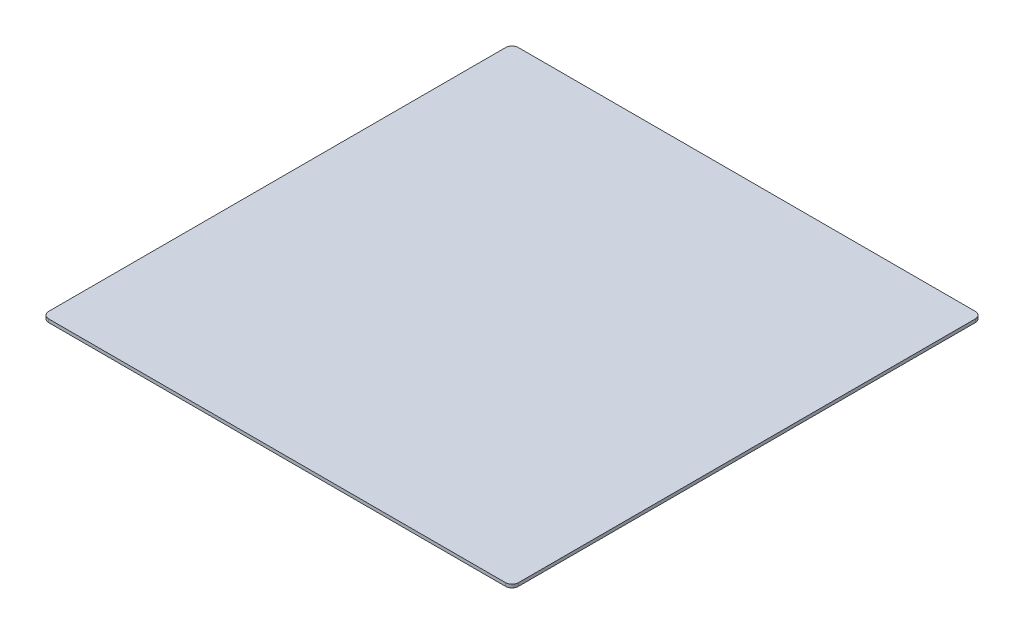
ISO-10303-21;
HEADER;
FILE_DESCRIPTION(('STEP AP214'),'2;1');
FILE_NAME('part.step','',(''),(''),'','','');
FILE_SCHEMA(('AUTOMOTIVE_DESIGN { 1 0 10303 214 1 1 1 1 }'));
ENDSEC;
DATA;
#1=APPLICATION_CONTEXT('core data for automotive mechanical design processes');
#2=APPLICATION_PROTOCOL_DEFINITION('international standard','automotive_design',2000,#1);
#3=PRODUCT_CONTEXT('',#1,'mechanical');
#4=PRODUCT('Part','Part','',(#3));
#5=PRODUCT_RELATED_PRODUCT_CATEGORY('part','',(#4));
#6=PRODUCT_DEFINITION_FORMATION('','',#4);
#7=PRODUCT_DEFINITION_CONTEXT('part definition',#1,'design');
#8=PRODUCT_DEFINITION('design','',#6,#7);
#9=PRODUCT_DEFINITION_SHAPE('','',#8);
#10=(LENGTH_UNIT() NAMED_UNIT(*) SI_UNIT(.MILLI.,.METRE.));
#11=(NAMED_UNIT(*) PLANE_ANGLE_UNIT() SI_UNIT($,.RADIAN.));
#12=(NAMED_UNIT(*) SI_UNIT($,.STERADIAN.) SOLID_ANGLE_UNIT());
#13=UNCERTAINTY_MEASURE_WITH_UNIT(LENGTH_MEASURE(1.E-05),#10,'distance_accuracy_value','');
#14=(GEOMETRIC_REPRESENTATION_CONTEXT(3) GLOBAL_UNCERTAINTY_ASSIGNED_CONTEXT((#13)) GLOBAL_UNIT_ASSIGNED_CONTEXT((#10,
#11,#12)) REPRESENTATION_CONTEXT('',''));
#15=CARTESIAN_POINT('',(0.,0.,0.));
#16=DIRECTION('',(0.,0.,1.));
#17=DIRECTION('',(1.,0.,0.));
#18=AXIS2_PLACEMENT_3D('',#15,#16,#17);
#19=CARTESIAN_POINT('',(228.6,3.175,228.6));
#20=DIRECTION('',(-1.,0.,0.));
#21=DIRECTION('',(0.,0.,1.));
#22=AXIS2_PLACEMENT_3D('',#19,#20,#21);
#23=PLANE('',#22);
#24=DIRECTION('',(0.,0.,-1.));
#25=VECTOR('',#24,1.);
#26=CARTESIAN_POINT('',(228.6,0.,228.6));
#27=LINE('',#26,#25);
#28=CARTESIAN_POINT('',(228.6,0.,222.25));
#29=VERTEX_POINT('',#28);
#30=CARTESIAN_POINT('',(228.6,0.,-222.25));
#31=VERTEX_POINT('',#30);
#32=EDGE_CURVE('E140',#29,#31,#27,.T.);
#33=ORIENTED_EDGE('',*,*,#32,.T.);
#34=DIRECTION('',(0.,-1.,0.));
#35=VECTOR('',#34,1.);
#36=CARTESIAN_POINT('',(228.6,3.175,-222.25));
#37=LINE('',#36,#35);
#38=CARTESIAN_POINT('',(228.6,3.175,-222.25));
#39=VERTEX_POINT('',#38);
#40=EDGE_CURVE('E174',#31,#39,#37,.F.);
#41=ORIENTED_EDGE('',*,*,#40,.T.);
#42=DIRECTION('',(0.,0.,-1.));
#43=VECTOR('',#42,1.);
#44=CARTESIAN_POINT('',(228.6,3.175,228.6));
#45=LINE('',#44,#43);
#46=CARTESIAN_POINT('',(228.6,3.175,222.25));
#47=VERTEX_POINT('',#46);
#48=EDGE_CURVE('E138',#47,#39,#45,.T.);
#49=ORIENTED_EDGE('',*,*,#48,.F.);
#50=DIRECTION('',(0.,-1.,0.));
#51=VECTOR('',#50,1.);
#52=CARTESIAN_POINT('',(228.6,3.175,222.25));
#53=LINE('',#52,#51);
#54=EDGE_CURVE('E170',#47,#29,#53,.T.);
#55=ORIENTED_EDGE('',*,*,#54,.T.);
#56=EDGE_LOOP('',(#33,#41,#49,#55));
#57=FACE_BOUND('',#56,.T.);
#58=ADVANCED_FACE('F38',(#57),#23,.F.);
#59=CARTESIAN_POINT('',(-228.6,3.175,-228.6));
#60=DIRECTION('',(0.,0.,1.));
#61=DIRECTION('',(1.,0.,0.));
#62=AXIS2_PLACEMENT_3D('',#59,#60,#61);
#63=PLANE('',#62);
#64=DIRECTION('',(-1.,0.,0.));
#65=VECTOR('',#64,1.);
#66=CARTESIAN_POINT('',(-228.6,0.,-228.6));
#67=LINE('',#66,#65);
#68=CARTESIAN_POINT('',(222.25,0.,-228.6));
#69=VERTEX_POINT('',#68);
#70=CARTESIAN_POINT('',(-222.25,0.,-228.6));
#71=VERTEX_POINT('',#70);
#72=EDGE_CURVE('E133',#69,#71,#67,.T.);
#73=ORIENTED_EDGE('',*,*,#72,.T.);
#74=DIRECTION('',(0.,-1.,0.));
#75=VECTOR('',#74,1.);
#76=CARTESIAN_POINT('',(-222.25,3.175,-228.6));
#77=LINE('',#76,#75);
#78=CARTESIAN_POINT('',(-222.25,3.175,-228.6));
#79=VERTEX_POINT('',#78);
#80=EDGE_CURVE('E109',#71,#79,#77,.F.);
#81=ORIENTED_EDGE('',*,*,#80,.T.);
#82=DIRECTION('',(-1.,0.,0.));
#83=VECTOR('',#82,1.);
#84=CARTESIAN_POINT('',(-228.6,3.175,-228.6));
#85=LINE('',#84,#83);
#86=CARTESIAN_POINT('',(222.25,3.175,-228.6));
#87=VERTEX_POINT('',#86);
#88=EDGE_CURVE('E194',#87,#79,#85,.T.);
#89=ORIENTED_EDGE('',*,*,#88,.F.);
#90=DIRECTION('',(0.,-1.,0.));
#91=VECTOR('',#90,1.);
#92=CARTESIAN_POINT('',(222.25,3.175,-228.6));
#93=LINE('',#92,#91);
#94=EDGE_CURVE('E115',#87,#69,#93,.T.);
#95=ORIENTED_EDGE('',*,*,#94,.T.);
#96=EDGE_LOOP('',(#73,#81,#89,#95));
#97=FACE_BOUND('',#96,.T.);
#98=ADVANCED_FACE('F219',(#97),#63,.F.);
#99=CARTESIAN_POINT('',(-228.6,3.175,228.6));
#100=DIRECTION('',(1.,0.,0.));
#101=DIRECTION('',(0.,0.,-1.));
#102=AXIS2_PLACEMENT_3D('',#99,#100,#101);
#103=PLANE('',#102);
#104=DIRECTION('',(0.,0.,1.));
#105=VECTOR('',#104,1.);
#106=CARTESIAN_POINT('',(-228.6,3.175,228.6));
#107=LINE('',#106,#105);
#108=CARTESIAN_POINT('',(-228.6,3.175,-222.25));
#109=VERTEX_POINT('',#108);
#110=CARTESIAN_POINT('',(-228.6,3.175,222.25));
#111=VERTEX_POINT('',#110);
#112=EDGE_CURVE('E124',#109,#111,#107,.T.);
#113=ORIENTED_EDGE('',*,*,#112,.F.);
#114=DIRECTION('',(0.,-1.,0.));
#115=VECTOR('',#114,1.);
#116=CARTESIAN_POINT('',(-228.6,3.175,-222.25));
#117=LINE('',#116,#115);
#118=CARTESIAN_POINT('',(-228.6,0.,-222.25));
#119=VERTEX_POINT('',#118);
#120=EDGE_CURVE('E108',#109,#119,#117,.T.);
#121=ORIENTED_EDGE('',*,*,#120,.T.);
#122=DIRECTION('',(0.,0.,1.));
#123=VECTOR('',#122,1.);
#124=CARTESIAN_POINT('',(-228.6,0.,228.6));
#125=LINE('',#124,#123);
#126=CARTESIAN_POINT('',(-228.6,0.,222.25));
#127=VERTEX_POINT('',#126);
#128=EDGE_CURVE('E122',#119,#127,#125,.T.);
#129=ORIENTED_EDGE('',*,*,#128,.T.);
#130=DIRECTION('',(0.,-1.,0.));
#131=VECTOR('',#130,1.);
#132=CARTESIAN_POINT('',(-228.6,3.175,222.25));
#133=LINE('',#132,#131);
#134=EDGE_CURVE('E127',#127,#111,#133,.F.);
#135=ORIENTED_EDGE('',*,*,#134,.T.);
#136=EDGE_LOOP('',(#113,#121,#129,#135));
#137=FACE_BOUND('',#136,.T.);
#138=ADVANCED_FACE('F121',(#137),#103,.F.);
#139=CARTESIAN_POINT('',(-228.6,3.175,228.6));
#140=DIRECTION('',(0.,0.,-1.));
#141=DIRECTION('',(-1.,0.,0.));
#142=AXIS2_PLACEMENT_3D('',#139,#140,#141);
#143=PLANE('',#142);
#144=DIRECTION('',(1.,0.,0.));
#145=VECTOR('',#144,1.);
#146=CARTESIAN_POINT('',(-228.6,0.,228.6));
#147=LINE('',#146,#145);
#148=CARTESIAN_POINT('',(-222.25,0.,228.6));
#149=VERTEX_POINT('',#148);
#150=CARTESIAN_POINT('',(222.25,0.,228.6));
#151=VERTEX_POINT('',#150);
#152=EDGE_CURVE('E132',#149,#151,#147,.T.);
#153=ORIENTED_EDGE('',*,*,#152,.T.);
#154=DIRECTION('',(0.,-1.,0.));
#155=VECTOR('',#154,1.);
#156=CARTESIAN_POINT('',(222.25,3.175,228.6));
#157=LINE('',#156,#155);
#158=CARTESIAN_POINT('',(222.25,3.175,228.6));
#159=VERTEX_POINT('',#158);
#160=EDGE_CURVE('E11',#151,#159,#157,.F.);
#161=ORIENTED_EDGE('',*,*,#160,.T.);
#162=DIRECTION('',(1.,0.,0.));
#163=VECTOR('',#162,1.);
#164=CARTESIAN_POINT('',(-228.6,3.175,228.6));
#165=LINE('',#164,#163);
#166=CARTESIAN_POINT('',(-222.25,3.175,228.6));
#167=VERTEX_POINT('',#166);
#168=EDGE_CURVE('E145',#167,#159,#165,.T.);
#169=ORIENTED_EDGE('',*,*,#168,.F.);
#170=DIRECTION('',(0.,-1.,0.));
#171=VECTOR('',#170,1.);
#172=CARTESIAN_POINT('',(-222.25,3.175,228.6));
#173=LINE('',#172,#171);
#174=EDGE_CURVE('E47',#167,#149,#173,.T.);
#175=ORIENTED_EDGE('',*,*,#174,.T.);
#176=EDGE_LOOP('',(#153,#161,#169,#175));
#177=FACE_BOUND('',#176,.T.);
#178=ADVANCED_FACE('F180',(#177),#143,.F.);
#179=CARTESIAN_POINT('',(0.,3.175,0.));
#180=DIRECTION('',(0.,-1.,0.));
#181=DIRECTION('',(0.,0.,-1.));
#182=AXIS2_PLACEMENT_3D('',#179,#180,#181);
#183=PLANE('',#182);
#184=ORIENTED_EDGE('',*,*,#88,.T.);
#185=CARTESIAN_POINT('',(-222.25,3.175,-222.25));
#186=DIRECTION('',(0.,-1.,0.));
#187=DIRECTION('',(0.,0.,-1.));
#188=AXIS2_PLACEMENT_3D('',#185,#186,#187);
#189=CIRCLE('',#188,6.35);
#190=EDGE_CURVE('E167',#79,#109,#189,.F.);
#191=ORIENTED_EDGE('',*,*,#190,.T.);
#192=ORIENTED_EDGE('',*,*,#112,.T.);
#193=CARTESIAN_POINT('',(-222.25,3.175,222.25));
#194=DIRECTION('',(0.,-1.,0.));
#195=DIRECTION('',(0.,0.,-1.));
#196=AXIS2_PLACEMENT_3D('',#193,#194,#195);
#197=CIRCLE('',#196,6.35);
#198=EDGE_CURVE('E59',#111,#167,#197,.F.);
#199=ORIENTED_EDGE('',*,*,#198,.T.);
#200=ORIENTED_EDGE('',*,*,#168,.T.);
#201=CARTESIAN_POINT('',(222.25,3.175,222.25));
#202=DIRECTION('',(0.,-1.,0.));
#203=DIRECTION('',(0.,0.,-1.));
#204=AXIS2_PLACEMENT_3D('',#201,#202,#203);
#205=CIRCLE('',#204,6.35);
#206=EDGE_CURVE('E161',#159,#47,#205,.F.);
#207=ORIENTED_EDGE('',*,*,#206,.T.);
#208=ORIENTED_EDGE('',*,*,#48,.T.);
#209=CARTESIAN_POINT('',(222.25,3.175,-222.25));
#210=DIRECTION('',(0.,-1.,0.));
#211=DIRECTION('',(0.,0.,-1.));
#212=AXIS2_PLACEMENT_3D('',#209,#210,#211);
#213=CIRCLE('',#212,6.35);
#214=EDGE_CURVE('E164',#39,#87,#213,.F.);
#215=ORIENTED_EDGE('',*,*,#214,.T.);
#216=EDGE_LOOP('',(#184,#191,#192,#199,#200,#207,#208,#215));
#217=FACE_BOUND('',#216,.T.);
#218=ADVANCED_FACE('F208',(#217),#183,.F.);
#219=CARTESIAN_POINT('',(0.,0.,0.));
#220=DIRECTION('',(0.,-1.,0.));
#221=DIRECTION('',(0.,0.,-1.));
#222=AXIS2_PLACEMENT_3D('',#219,#220,#221);
#223=PLANE('',#222);
#224=ORIENTED_EDGE('',*,*,#128,.F.);
#225=CARTESIAN_POINT('',(-222.25,0.,-222.25));
#226=DIRECTION('',(0.,-1.,0.));
#227=DIRECTION('',(0.,0.,-1.));
#228=AXIS2_PLACEMENT_3D('',#225,#226,#227);
#229=CIRCLE('',#228,6.35);
#230=EDGE_CURVE('E104',#119,#71,#229,.T.);
#231=ORIENTED_EDGE('',*,*,#230,.T.);
#232=ORIENTED_EDGE('',*,*,#72,.F.);
#233=CARTESIAN_POINT('',(222.25,0.,-222.25));
#234=DIRECTION('',(0.,-1.,0.));
#235=DIRECTION('',(0.,0.,-1.));
#236=AXIS2_PLACEMENT_3D('',#233,#234,#235);
#237=CIRCLE('',#236,6.35);
#238=EDGE_CURVE('E116',#69,#31,#237,.T.);
#239=ORIENTED_EDGE('',*,*,#238,.T.);
#240=ORIENTED_EDGE('',*,*,#32,.F.);
#241=CARTESIAN_POINT('',(222.25,0.,222.25));
#242=DIRECTION('',(0.,-1.,0.));
#243=DIRECTION('',(0.,0.,-1.));
#244=AXIS2_PLACEMENT_3D('',#241,#242,#243);
#245=CIRCLE('',#244,6.35);
#246=EDGE_CURVE('E149',#29,#151,#245,.T.);
#247=ORIENTED_EDGE('',*,*,#246,.T.);
#248=ORIENTED_EDGE('',*,*,#152,.F.);
#249=CARTESIAN_POINT('',(-222.25,0.,222.25));
#250=DIRECTION('',(0.,-1.,0.));
#251=DIRECTION('',(0.,0.,-1.));
#252=AXIS2_PLACEMENT_3D('',#249,#250,#251);
#253=CIRCLE('',#252,6.35);
#254=EDGE_CURVE('E126',#149,#127,#253,.T.);
#255=ORIENTED_EDGE('',*,*,#254,.T.);
#256=EDGE_LOOP('',(#224,#231,#232,#239,#240,#247,#248,#255));
#257=FACE_BOUND('',#256,.T.);
#258=ADVANCED_FACE('F129',(#257),#223,.T.);
#259=CARTESIAN_POINT('',(-222.25,3.175,-222.25));
#260=DIRECTION('',(0.,-1.,0.));
#261=DIRECTION('',(0.,0.,-1.));
#262=AXIS2_PLACEMENT_3D('',#259,#260,#261);
#263=CYLINDRICAL_SURFACE('',#262,6.35);
#264=ORIENTED_EDGE('',*,*,#190,.F.);
#265=ORIENTED_EDGE('',*,*,#80,.F.);
#266=ORIENTED_EDGE('',*,*,#230,.F.);
#267=ORIENTED_EDGE('',*,*,#120,.F.);
#268=EDGE_LOOP('',(#264,#265,#266,#267));
#269=FACE_BOUND('',#268,.T.);
#270=ADVANCED_FACE('F107',(#269),#263,.T.);
#271=CARTESIAN_POINT('',(222.25,3.175,-222.25));
#272=DIRECTION('',(0.,-1.,0.));
#273=DIRECTION('',(0.,0.,-1.));
#274=AXIS2_PLACEMENT_3D('',#271,#272,#273);
#275=CYLINDRICAL_SURFACE('',#274,6.35);
#276=ORIENTED_EDGE('',*,*,#214,.F.);
#277=ORIENTED_EDGE('',*,*,#40,.F.);
#278=ORIENTED_EDGE('',*,*,#238,.F.);
#279=ORIENTED_EDGE('',*,*,#94,.F.);
#280=EDGE_LOOP('',(#276,#277,#278,#279));
#281=FACE_BOUND('',#280,.T.);
#282=ADVANCED_FACE('F230',(#281),#275,.T.);
#283=CARTESIAN_POINT('',(222.25,3.175,222.25));
#284=DIRECTION('',(0.,-1.,0.));
#285=DIRECTION('',(0.,0.,-1.));
#286=AXIS2_PLACEMENT_3D('',#283,#284,#285);
#287=CYLINDRICAL_SURFACE('',#286,6.35);
#288=ORIENTED_EDGE('',*,*,#206,.F.);
#289=ORIENTED_EDGE('',*,*,#160,.F.);
#290=ORIENTED_EDGE('',*,*,#246,.F.);
#291=ORIENTED_EDGE('',*,*,#54,.F.);
#292=EDGE_LOOP('',(#288,#289,#290,#291));
#293=FACE_BOUND('',#292,.T.);
#294=ADVANCED_FACE('F187',(#293),#287,.T.);
#295=CARTESIAN_POINT('',(-222.25,3.175,222.25));
#296=DIRECTION('',(0.,-1.,0.));
#297=DIRECTION('',(0.,0.,-1.));
#298=AXIS2_PLACEMENT_3D('',#295,#296,#297);
#299=CYLINDRICAL_SURFACE('',#298,6.35);
#300=ORIENTED_EDGE('',*,*,#198,.F.);
#301=ORIENTED_EDGE('',*,*,#134,.F.);
#302=ORIENTED_EDGE('',*,*,#254,.F.);
#303=ORIENTED_EDGE('',*,*,#174,.F.);
#304=EDGE_LOOP('',(#300,#301,#302,#303));
#305=FACE_BOUND('',#304,.T.);
#306=ADVANCED_FACE('F40',(#305),#299,.T.);
#307=CLOSED_SHELL('',(#58,#98,#138,#178,#218,#258,#270,#282,#294,#306));
#308=MANIFOLD_SOLID_BREP('B2',#307);
#309=ADVANCED_BREP_SHAPE_REPRESENTATION('',(#18,#308),#14);
#310=SHAPE_DEFINITION_REPRESENTATION(#9,#309);
ENDSEC;
END-ISO-10303-21;
